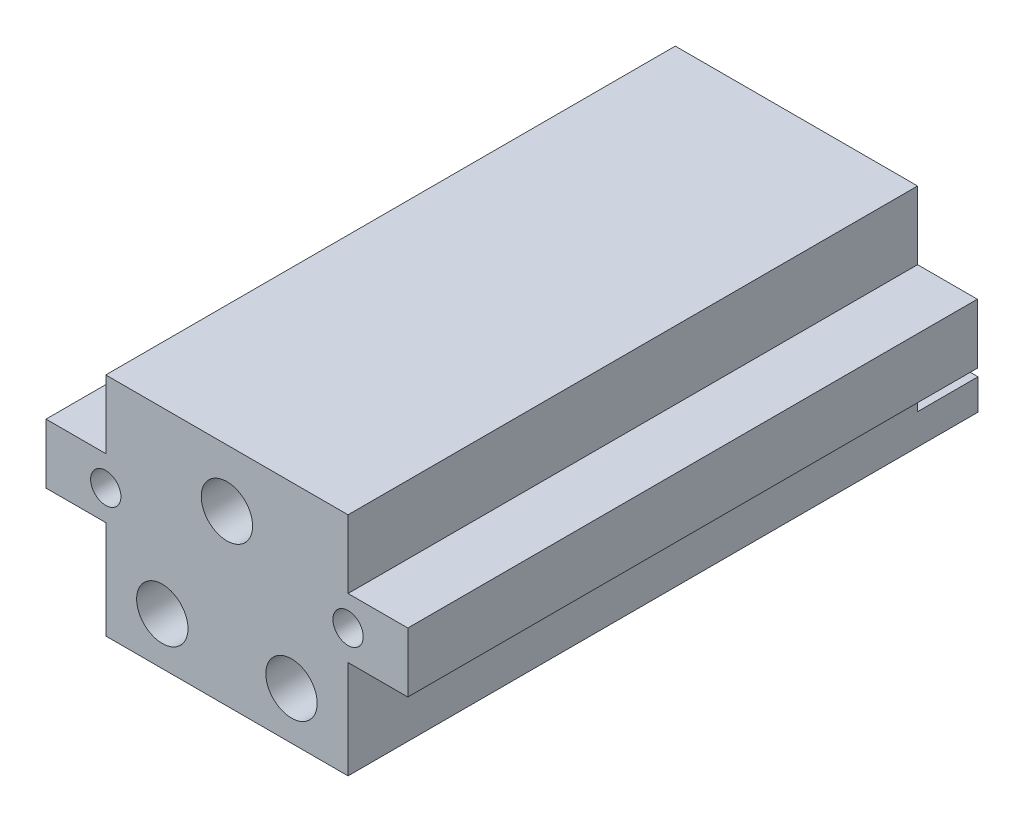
ISO-10303-21;
HEADER;
FILE_DESCRIPTION(('STEP AP214'),'2;1');
FILE_NAME('part.step','',(''),(''),'','','');
FILE_SCHEMA(('AUTOMOTIVE_DESIGN { 1 0 10303 214 1 1 1 1 }'));
ENDSEC;
DATA;
#1=APPLICATION_CONTEXT('core data for automotive mechanical design processes');
#2=APPLICATION_PROTOCOL_DEFINITION('international standard','automotive_design',2000,#1);
#3=PRODUCT_CONTEXT('',#1,'mechanical');
#4=PRODUCT('Part','Part','',(#3));
#5=PRODUCT_RELATED_PRODUCT_CATEGORY('part','',(#4));
#6=PRODUCT_DEFINITION_FORMATION('','',#4);
#7=PRODUCT_DEFINITION_CONTEXT('part definition',#1,'design');
#8=PRODUCT_DEFINITION('design','',#6,#7);
#9=PRODUCT_DEFINITION_SHAPE('','',#8);
#10=(LENGTH_UNIT() NAMED_UNIT(*) SI_UNIT(.MILLI.,.METRE.));
#11=(NAMED_UNIT(*) PLANE_ANGLE_UNIT() SI_UNIT($,.RADIAN.));
#12=(NAMED_UNIT(*) SI_UNIT($,.STERADIAN.) SOLID_ANGLE_UNIT());
#13=UNCERTAINTY_MEASURE_WITH_UNIT(LENGTH_MEASURE(1.E-05),#10,'distance_accuracy_value','');
#14=(GEOMETRIC_REPRESENTATION_CONTEXT(3) GLOBAL_UNCERTAINTY_ASSIGNED_CONTEXT((#13)) GLOBAL_UNIT_ASSIGNED_CONTEXT((#10,
#11,#12)) REPRESENTATION_CONTEXT('',''));
#15=CARTESIAN_POINT('',(0.,0.,0.));
#16=DIRECTION('',(0.,0.,1.));
#17=DIRECTION('',(1.,0.,0.));
#18=AXIS2_PLACEMENT_3D('',#15,#16,#17);
#19=CARTESIAN_POINT('',(-9.525,2.3495,24.765));
#20=DIRECTION('',(1.,0.,0.));
#21=DIRECTION('',(0.,1.,0.));
#22=AXIS2_PLACEMENT_3D('',#19,#20,#21);
#23=PLANE('',#22);
#24=DIRECTION('',(0.,1.,0.));
#25=VECTOR('',#24,1.);
#26=CARTESIAN_POINT('',(-9.525,2.3495,-20.0152));
#27=LINE('',#26,#25);
#28=CARTESIAN_POINT('',(-9.525,2.3495,-20.0152));
#29=VERTEX_POINT('',#28);
#30=CARTESIAN_POINT('',(-9.525,7.7089,-20.0152));
#31=VERTEX_POINT('',#30);
#32=EDGE_CURVE('E243',#29,#31,#27,.T.);
#33=ORIENTED_EDGE('',*,*,#32,.F.);
#34=DIRECTION('',(0.,0.,-1.));
#35=VECTOR('',#34,1.);
#36=CARTESIAN_POINT('',(-9.525,2.3495,24.765));
#37=LINE('',#36,#35);
#38=CARTESIAN_POINT('',(-9.525,2.3495,24.765));
#39=VERTEX_POINT('',#38);
#40=EDGE_CURVE('E42',#39,#29,#37,.T.);
#41=ORIENTED_EDGE('',*,*,#40,.F.);
#42=DIRECTION('',(0.,-1.,0.));
#43=VECTOR('',#42,1.);
#44=CARTESIAN_POINT('',(-9.525,2.3495,24.765));
#45=LINE('',#44,#43);
#46=CARTESIAN_POINT('',(-9.525,7.7089,24.765));
#47=VERTEX_POINT('',#46);
#48=EDGE_CURVE('E253',#47,#39,#45,.T.);
#49=ORIENTED_EDGE('',*,*,#48,.F.);
#50=DIRECTION('',(0.,0.,-1.));
#51=VECTOR('',#50,1.);
#52=CARTESIAN_POINT('',(-9.525,7.7089,24.765));
#53=LINE('',#52,#51);
#54=EDGE_CURVE('E276',#47,#31,#53,.T.);
#55=ORIENTED_EDGE('',*,*,#54,.T.);
#56=EDGE_LOOP('',(#33,#41,#49,#55));
#57=FACE_BOUND('',#56,.T.);
#58=ADVANCED_FACE('F35',(#57),#23,.F.);
#59=CARTESIAN_POINT('',(-14.224,2.3495,24.765));
#60=DIRECTION('',(0.,-1.,0.));
#61=DIRECTION('',(1.,0.,0.));
#62=AXIS2_PLACEMENT_3D('',#59,#60,#61);
#63=PLANE('',#62);
#64=DIRECTION('',(1.,0.,0.));
#65=VECTOR('',#64,1.);
#66=CARTESIAN_POINT('',(-14.224,2.3495,-20.0152));
#67=LINE('',#66,#65);
#68=CARTESIAN_POINT('',(-14.224,2.3495,-20.0152));
#69=VERTEX_POINT('',#68);
#70=EDGE_CURVE('E241',#69,#29,#67,.T.);
#71=ORIENTED_EDGE('',*,*,#70,.F.);
#72=DIRECTION('',(0.,0.,-1.));
#73=VECTOR('',#72,1.);
#74=CARTESIAN_POINT('',(-14.224,2.3495,24.765));
#75=LINE('',#74,#73);
#76=CARTESIAN_POINT('',(-14.224,2.3495,24.765));
#77=VERTEX_POINT('',#76);
#78=EDGE_CURVE('E305',#77,#69,#75,.T.);
#79=ORIENTED_EDGE('',*,*,#78,.F.);
#80=DIRECTION('',(-1.,0.,0.));
#81=VECTOR('',#80,1.);
#82=CARTESIAN_POINT('',(-14.224,2.3495,24.765));
#83=LINE('',#82,#81);
#84=EDGE_CURVE('E255',#39,#77,#83,.T.);
#85=ORIENTED_EDGE('',*,*,#84,.F.);
#86=ORIENTED_EDGE('',*,*,#40,.T.);
#87=EDGE_LOOP('',(#71,#79,#85,#86));
#88=FACE_BOUND('',#87,.T.);
#89=ADVANCED_FACE('F311',(#88),#63,.F.);
#90=CARTESIAN_POINT('',(-14.224,-2.3495,24.765));
#91=DIRECTION('',(1.,0.,0.));
#92=DIRECTION('',(0.,1.,0.));
#93=AXIS2_PLACEMENT_3D('',#90,#91,#92);
#94=PLANE('',#93);
#95=DIRECTION('',(0.,1.,0.));
#96=VECTOR('',#95,1.);
#97=CARTESIAN_POINT('',(-14.224,-7.6581,-20.0152));
#98=LINE('',#97,#96);
#99=CARTESIAN_POINT('',(-14.224,-2.3495,-20.0152));
#100=VERTEX_POINT('',#99);
#101=EDGE_CURVE('E218',#100,#69,#98,.T.);
#102=ORIENTED_EDGE('',*,*,#101,.F.);
#103=DIRECTION('',(0.,0.,-1.));
#104=VECTOR('',#103,1.);
#105=CARTESIAN_POINT('',(-14.224,-2.3495,24.765));
#106=LINE('',#105,#104);
#107=CARTESIAN_POINT('',(-14.224,-2.3495,24.765));
#108=VERTEX_POINT('',#107);
#109=EDGE_CURVE('E302',#108,#100,#106,.T.);
#110=ORIENTED_EDGE('',*,*,#109,.F.);
#111=DIRECTION('',(0.,-1.,0.));
#112=VECTOR('',#111,1.);
#113=CARTESIAN_POINT('',(-14.224,-2.3495,24.765));
#114=LINE('',#113,#112);
#115=EDGE_CURVE('E257',#77,#108,#114,.T.);
#116=ORIENTED_EDGE('',*,*,#115,.F.);
#117=ORIENTED_EDGE('',*,*,#78,.T.);
#118=EDGE_LOOP('',(#102,#110,#116,#117));
#119=FACE_BOUND('',#118,.T.);
#120=ADVANCED_FACE('F369',(#119),#94,.F.);
#121=CARTESIAN_POINT('',(-9.525,-2.3495,24.765));
#122=DIRECTION('',(0.,1.,0.));
#123=DIRECTION('',(-1.,0.,0.));
#124=AXIS2_PLACEMENT_3D('',#121,#122,#123);
#125=PLANE('',#124);
#126=DIRECTION('',(-1.,0.,0.));
#127=VECTOR('',#126,1.);
#128=CARTESIAN_POINT('',(-9.52499999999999,-2.3495,-20.0152));
#129=LINE('',#128,#127);
#130=CARTESIAN_POINT('',(-9.525,-2.3495,-20.0152));
#131=VERTEX_POINT('',#130);
#132=EDGE_CURVE('E239',#131,#100,#129,.T.);
#133=ORIENTED_EDGE('',*,*,#132,.F.);
#134=DIRECTION('',(0.,0.,-1.));
#135=VECTOR('',#134,1.);
#136=CARTESIAN_POINT('',(-9.525,-2.3495,24.765));
#137=LINE('',#136,#135);
#138=CARTESIAN_POINT('',(-9.525,-2.3495,24.765));
#139=VERTEX_POINT('',#138);
#140=EDGE_CURVE('E299',#139,#131,#137,.T.);
#141=ORIENTED_EDGE('',*,*,#140,.F.);
#142=DIRECTION('',(1.,0.,0.));
#143=VECTOR('',#142,1.);
#144=CARTESIAN_POINT('',(-9.525,-2.3495,24.765));
#145=LINE('',#144,#143);
#146=EDGE_CURVE('E259',#108,#139,#145,.T.);
#147=ORIENTED_EDGE('',*,*,#146,.F.);
#148=ORIENTED_EDGE('',*,*,#109,.T.);
#149=EDGE_LOOP('',(#133,#141,#147,#148));
#150=FACE_BOUND('',#149,.T.);
#151=ADVANCED_FACE('F366',(#150),#125,.F.);
#152=CARTESIAN_POINT('',(-9.525,-10.0711,24.765));
#153=DIRECTION('',(1.,0.,0.));
#154=DIRECTION('',(0.,1.,0.));
#155=AXIS2_PLACEMENT_3D('',#152,#153,#154);
#156=PLANE('',#155);
#157=DIRECTION('',(0.,1.,0.));
#158=VECTOR('',#157,1.);
#159=CARTESIAN_POINT('',(-9.525,-10.0711,-20.0152));
#160=LINE('',#159,#158);
#161=CARTESIAN_POINT('',(-9.525,-7.6581,-20.0152));
#162=VERTEX_POINT('',#161);
#163=EDGE_CURVE('E237',#162,#131,#160,.T.);
#164=ORIENTED_EDGE('',*,*,#163,.F.);
#165=DIRECTION('',(0.,0.,-1.));
#166=VECTOR('',#165,1.);
#167=CARTESIAN_POINT('',(-9.525,-7.6581,24.765));
#168=LINE('',#167,#166);
#169=CARTESIAN_POINT('',(-9.525,-7.6581,-24.765));
#170=VERTEX_POINT('',#169);
#171=EDGE_CURVE('E226',#162,#170,#168,.T.);
#172=ORIENTED_EDGE('',*,*,#171,.T.);
#173=DIRECTION('',(0.,-1.,0.));
#174=VECTOR('',#173,1.);
#175=CARTESIAN_POINT('',(-9.525,-10.0711,-24.765));
#176=LINE('',#175,#174);
#177=CARTESIAN_POINT('',(-9.525,-10.0711,-24.765));
#178=VERTEX_POINT('',#177);
#179=EDGE_CURVE('E245',#170,#178,#176,.T.);
#180=ORIENTED_EDGE('',*,*,#179,.T.);
#181=DIRECTION('',(0.,0.,-1.));
#182=VECTOR('',#181,1.);
#183=CARTESIAN_POINT('',(-9.525,-10.0711,24.765));
#184=LINE('',#183,#182);
#185=CARTESIAN_POINT('',(-9.525,-10.0711,24.765));
#186=VERTEX_POINT('',#185);
#187=EDGE_CURVE('E296',#186,#178,#184,.T.);
#188=ORIENTED_EDGE('',*,*,#187,.F.);
#189=DIRECTION('',(0.,-1.,0.));
#190=VECTOR('',#189,1.);
#191=CARTESIAN_POINT('',(-9.525,-10.0711,24.765));
#192=LINE('',#191,#190);
#193=EDGE_CURVE('E261',#139,#186,#192,.T.);
#194=ORIENTED_EDGE('',*,*,#193,.F.);
#195=ORIENTED_EDGE('',*,*,#140,.T.);
#196=EDGE_LOOP('',(#164,#172,#180,#188,#194,#195));
#197=FACE_BOUND('',#196,.T.);
#198=ADVANCED_FACE('F348',(#197),#156,.F.);
#199=CARTESIAN_POINT('',(9.52500000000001,-2.3495,24.765));
#200=DIRECTION('',(-1.,0.,0.));
#201=DIRECTION('',(0.,-1.,0.));
#202=AXIS2_PLACEMENT_3D('',#199,#200,#201);
#203=PLANE('',#202);
#204=DIRECTION('',(0.,-1.,0.));
#205=VECTOR('',#204,1.);
#206=CARTESIAN_POINT('',(9.52500000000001,-2.3495,-20.0152));
#207=LINE('',#206,#205);
#208=CARTESIAN_POINT('',(9.52500000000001,-2.3495,-20.0152));
#209=VERTEX_POINT('',#208);
#210=CARTESIAN_POINT('',(9.525,-7.6581,-20.0152));
#211=VERTEX_POINT('',#210);
#212=EDGE_CURVE('E235',#209,#211,#207,.T.);
#213=ORIENTED_EDGE('',*,*,#212,.F.);
#214=DIRECTION('',(0.,0.,-1.));
#215=VECTOR('',#214,1.);
#216=CARTESIAN_POINT('',(9.52500000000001,-2.3495,24.765));
#217=LINE('',#216,#215);
#218=CARTESIAN_POINT('',(9.52500000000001,-2.3495,24.765));
#219=VERTEX_POINT('',#218);
#220=EDGE_CURVE('E291',#219,#209,#217,.T.);
#221=ORIENTED_EDGE('',*,*,#220,.F.);
#222=DIRECTION('',(0.,1.,0.));
#223=VECTOR('',#222,1.);
#224=CARTESIAN_POINT('',(9.52500000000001,-2.3495,24.765));
#225=LINE('',#224,#223);
#226=CARTESIAN_POINT('',(9.525,-10.0711,24.765));
#227=VERTEX_POINT('',#226);
#228=EDGE_CURVE('E265',#227,#219,#225,.T.);
#229=ORIENTED_EDGE('',*,*,#228,.F.);
#230=DIRECTION('',(0.,0.,-1.));
#231=VECTOR('',#230,1.);
#232=CARTESIAN_POINT('',(9.525,-10.0711,24.765));
#233=LINE('',#232,#231);
#234=CARTESIAN_POINT('',(9.525,-10.0711,-24.765));
#235=VERTEX_POINT('',#234);
#236=EDGE_CURVE('E294',#227,#235,#233,.T.);
#237=ORIENTED_EDGE('',*,*,#236,.T.);
#238=DIRECTION('',(0.,1.,0.));
#239=VECTOR('',#238,1.);
#240=CARTESIAN_POINT('',(9.52500000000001,-2.3495,-24.765));
#241=LINE('',#240,#239);
#242=CARTESIAN_POINT('',(9.525,-7.6581,-24.765));
#243=VERTEX_POINT('',#242);
#244=EDGE_CURVE('E250',#235,#243,#241,.T.);
#245=ORIENTED_EDGE('',*,*,#244,.T.);
#246=DIRECTION('',(0.,0.,1.));
#247=VECTOR('',#246,1.);
#248=CARTESIAN_POINT('',(9.525,-7.6581,24.765));
#249=LINE('',#248,#247);
#250=EDGE_CURVE('E49',#243,#211,#249,.T.);
#251=ORIENTED_EDGE('',*,*,#250,.T.);
#252=EDGE_LOOP('',(#213,#221,#229,#237,#245,#251));
#253=FACE_BOUND('',#252,.T.);
#254=ADVANCED_FACE('F343',(#253),#203,.F.);
#255=CARTESIAN_POINT('',(14.224,-2.3495,24.765));
#256=DIRECTION('',(0.,1.,0.));
#257=DIRECTION('',(-1.,0.,0.));
#258=AXIS2_PLACEMENT_3D('',#255,#256,#257);
#259=PLANE('',#258);
#260=DIRECTION('',(-1.,0.,0.));
#261=VECTOR('',#260,1.);
#262=CARTESIAN_POINT('',(14.224,-2.3495,-20.0152));
#263=LINE('',#262,#261);
#264=CARTESIAN_POINT('',(14.224,-2.3495,-20.0152));
#265=VERTEX_POINT('',#264);
#266=EDGE_CURVE('E233',#265,#209,#263,.T.);
#267=ORIENTED_EDGE('',*,*,#266,.F.);
#268=DIRECTION('',(0.,0.,-1.));
#269=VECTOR('',#268,1.);
#270=CARTESIAN_POINT('',(14.224,-2.3495,24.765));
#271=LINE('',#270,#269);
#272=CARTESIAN_POINT('',(14.224,-2.3495,24.765));
#273=VERTEX_POINT('',#272);
#274=EDGE_CURVE('E288',#273,#265,#271,.T.);
#275=ORIENTED_EDGE('',*,*,#274,.F.);
#276=DIRECTION('',(1.,0.,0.));
#277=VECTOR('',#276,1.);
#278=CARTESIAN_POINT('',(14.224,-2.3495,24.765));
#279=LINE('',#278,#277);
#280=EDGE_CURVE('E267',#219,#273,#279,.T.);
#281=ORIENTED_EDGE('',*,*,#280,.F.);
#282=ORIENTED_EDGE('',*,*,#220,.T.);
#283=EDGE_LOOP('',(#267,#275,#281,#282));
#284=FACE_BOUND('',#283,.T.);
#285=ADVANCED_FACE('F338',(#284),#259,.F.);
#286=CARTESIAN_POINT('',(14.224,2.3495,24.765));
#287=DIRECTION('',(-1.,0.,0.));
#288=DIRECTION('',(0.,0.,1.));
#289=AXIS2_PLACEMENT_3D('',#286,#287,#288);
#290=PLANE('',#289);
#291=DIRECTION('',(0.,1.,0.));
#292=VECTOR('',#291,1.);
#293=CARTESIAN_POINT('',(14.224,-7.6581,-20.0152));
#294=LINE('',#293,#292);
#295=CARTESIAN_POINT('',(14.224,2.3495,-20.0152));
#296=VERTEX_POINT('',#295);
#297=EDGE_CURVE('E222',#265,#296,#294,.T.);
#298=ORIENTED_EDGE('',*,*,#297,.T.);
#299=DIRECTION('',(0.,0.,-1.));
#300=VECTOR('',#299,1.);
#301=CARTESIAN_POINT('',(14.224,2.3495,24.765));
#302=LINE('',#301,#300);
#303=CARTESIAN_POINT('',(14.224,2.3495,24.765));
#304=VERTEX_POINT('',#303);
#305=EDGE_CURVE('E285',#304,#296,#302,.T.);
#306=ORIENTED_EDGE('',*,*,#305,.F.);
#307=DIRECTION('',(0.,1.,0.));
#308=VECTOR('',#307,1.);
#309=CARTESIAN_POINT('',(14.224,2.3495,24.765));
#310=LINE('',#309,#308);
#311=EDGE_CURVE('E269',#273,#304,#310,.T.);
#312=ORIENTED_EDGE('',*,*,#311,.F.);
#313=ORIENTED_EDGE('',*,*,#274,.T.);
#314=EDGE_LOOP('',(#298,#306,#312,#313));
#315=FACE_BOUND('',#314,.T.);
#316=ADVANCED_FACE('F333',(#315),#290,.F.);
#317=CARTESIAN_POINT('',(9.52500000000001,2.3495,24.765));
#318=DIRECTION('',(0.,-1.,0.));
#319=DIRECTION('',(0.,0.,-1.));
#320=AXIS2_PLACEMENT_3D('',#317,#318,#319);
#321=PLANE('',#320);
#322=DIRECTION('',(1.,0.,0.));
#323=VECTOR('',#322,1.);
#324=CARTESIAN_POINT('',(9.52500000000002,2.3495,-20.0152));
#325=LINE('',#324,#323);
#326=CARTESIAN_POINT('',(9.52500000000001,2.3495,-20.0152));
#327=VERTEX_POINT('',#326);
#328=EDGE_CURVE('E231',#327,#296,#325,.T.);
#329=ORIENTED_EDGE('',*,*,#328,.F.);
#330=DIRECTION('',(0.,0.,-1.));
#331=VECTOR('',#330,1.);
#332=CARTESIAN_POINT('',(9.52500000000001,2.3495,24.765));
#333=LINE('',#332,#331);
#334=CARTESIAN_POINT('',(9.52500000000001,2.3495,24.765));
#335=VERTEX_POINT('',#334);
#336=EDGE_CURVE('E282',#335,#327,#333,.T.);
#337=ORIENTED_EDGE('',*,*,#336,.F.);
#338=DIRECTION('',(-1.,0.,0.));
#339=VECTOR('',#338,1.);
#340=CARTESIAN_POINT('',(9.52500000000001,2.3495,24.765));
#341=LINE('',#340,#339);
#342=EDGE_CURVE('E271',#304,#335,#341,.T.);
#343=ORIENTED_EDGE('',*,*,#342,.F.);
#344=ORIENTED_EDGE('',*,*,#305,.T.);
#345=EDGE_LOOP('',(#329,#337,#343,#344));
#346=FACE_BOUND('',#345,.T.);
#347=ADVANCED_FACE('F328',(#346),#321,.F.);
#348=CARTESIAN_POINT('',(9.52500000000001,7.7089,24.765));
#349=DIRECTION('',(-1.,0.,0.));
#350=DIRECTION('',(0.,-1.,0.));
#351=AXIS2_PLACEMENT_3D('',#348,#349,#350);
#352=PLANE('',#351);
#353=DIRECTION('',(0.,-1.,0.));
#354=VECTOR('',#353,1.);
#355=CARTESIAN_POINT('',(9.52500000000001,7.7089,-20.0152));
#356=LINE('',#355,#354);
#357=CARTESIAN_POINT('',(9.52500000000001,7.7089,-20.0152));
#358=VERTEX_POINT('',#357);
#359=EDGE_CURVE('E229',#358,#327,#356,.T.);
#360=ORIENTED_EDGE('',*,*,#359,.F.);
#361=DIRECTION('',(0.,0.,-1.));
#362=VECTOR('',#361,1.);
#363=CARTESIAN_POINT('',(9.52500000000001,7.7089,24.765));
#364=LINE('',#363,#362);
#365=CARTESIAN_POINT('',(9.52500000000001,7.7089,24.765));
#366=VERTEX_POINT('',#365);
#367=EDGE_CURVE('E279',#366,#358,#364,.T.);
#368=ORIENTED_EDGE('',*,*,#367,.F.);
#369=DIRECTION('',(0.,1.,0.));
#370=VECTOR('',#369,1.);
#371=CARTESIAN_POINT('',(9.52500000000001,7.7089,24.765));
#372=LINE('',#371,#370);
#373=EDGE_CURVE('E273',#335,#366,#372,.T.);
#374=ORIENTED_EDGE('',*,*,#373,.F.);
#375=ORIENTED_EDGE('',*,*,#336,.T.);
#376=EDGE_LOOP('',(#360,#368,#374,#375));
#377=FACE_BOUND('',#376,.T.);
#378=ADVANCED_FACE('F324',(#377),#352,.F.);
#379=CARTESIAN_POINT('',(-9.525,7.7089,24.765));
#380=DIRECTION('',(0.,-1.,0.));
#381=DIRECTION('',(1.,0.,0.));
#382=AXIS2_PLACEMENT_3D('',#379,#380,#381);
#383=PLANE('',#382);
#384=DIRECTION('',(-1.,0.,0.));
#385=VECTOR('',#384,1.);
#386=CARTESIAN_POINT('',(14.224,7.7089,-20.0152));
#387=LINE('',#386,#385);
#388=EDGE_CURVE('E214',#358,#31,#387,.T.);
#389=ORIENTED_EDGE('',*,*,#388,.T.);
#390=ORIENTED_EDGE('',*,*,#54,.F.);
#391=DIRECTION('',(-1.,0.,0.));
#392=VECTOR('',#391,1.);
#393=CARTESIAN_POINT('',(-9.525,7.7089,24.765));
#394=LINE('',#393,#392);
#395=EDGE_CURVE('E56',#366,#47,#394,.T.);
#396=ORIENTED_EDGE('',*,*,#395,.F.);
#397=ORIENTED_EDGE('',*,*,#367,.T.);
#398=EDGE_LOOP('',(#389,#390,#396,#397));
#399=FACE_BOUND('',#398,.T.);
#400=ADVANCED_FACE('F320',(#399),#383,.F.);
#401=CARTESIAN_POINT('',(9.525,-10.0711,24.765));
#402=DIRECTION('',(0.,1.,0.));
#403=DIRECTION('',(-1.,0.,0.));
#404=AXIS2_PLACEMENT_3D('',#401,#402,#403);
#405=PLANE('',#404);
#406=CARTESIAN_POINT('',(0.,-10.0711,8.89));
#407=DIRECTION('',(0.,-1.,0.));
#408=DIRECTION('',(0.,0.,-1.));
#409=AXIS2_PLACEMENT_3D('',#406,#407,#408);
#410=CIRCLE('',#409,3.17499999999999);
#411=CARTESIAN_POINT('',(0.,-10.0711,5.71500000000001));
#412=VERTEX_POINT('',#411);
#413=EDGE_CURVE('E196',#412,#412,#410,.T.);
#414=ORIENTED_EDGE('',*,*,#413,.F.);
#415=EDGE_LOOP('',(#414));
#416=FACE_BOUND('',#415,.T.);
#417=CARTESIAN_POINT('',(0.,-10.0711,19.2024));
#418=DIRECTION('',(0.,-1.,0.));
#419=DIRECTION('',(0.,0.,-1.));
#420=AXIS2_PLACEMENT_3D('',#417,#418,#419);
#421=CIRCLE('',#420,2.7051);
#422=CARTESIAN_POINT('',(0.,-10.0711,16.4973));
#423=VERTEX_POINT('',#422);
#424=EDGE_CURVE('E205',#423,#423,#421,.T.);
#425=ORIENTED_EDGE('',*,*,#424,.F.);
#426=EDGE_LOOP('',(#425));
#427=FACE_BOUND('',#426,.T.);
#428=CARTESIAN_POINT('',(0.,-10.0711,-1.42240000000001));
#429=DIRECTION('',(0.,-1.,0.));
#430=DIRECTION('',(0.,0.,-1.));
#431=AXIS2_PLACEMENT_3D('',#428,#429,#430);
#432=CIRCLE('',#431,2.7051);
#433=CARTESIAN_POINT('',(0.,-10.0711,-4.12750000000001));
#434=VERTEX_POINT('',#433);
#435=EDGE_CURVE('E211',#434,#434,#432,.T.);
#436=ORIENTED_EDGE('',*,*,#435,.F.);
#437=EDGE_LOOP('',(#436));
#438=FACE_BOUND('',#437,.T.);
#439=ORIENTED_EDGE('',*,*,#187,.T.);
#440=DIRECTION('',(1.,0.,0.));
#441=VECTOR('',#440,1.);
#442=CARTESIAN_POINT('',(9.525,-10.0711,-24.765));
#443=LINE('',#442,#441);
#444=EDGE_CURVE('E247',#178,#235,#443,.T.);
#445=ORIENTED_EDGE('',*,*,#444,.T.);
#446=ORIENTED_EDGE('',*,*,#236,.F.);
#447=DIRECTION('',(1.,0.,0.));
#448=VECTOR('',#447,1.);
#449=CARTESIAN_POINT('',(9.525,-10.0711,24.765));
#450=LINE('',#449,#448);
#451=EDGE_CURVE('E263',#186,#227,#450,.T.);
#452=ORIENTED_EDGE('',*,*,#451,.F.);
#453=EDGE_LOOP('',(#439,#445,#446,#452));
#454=FACE_BOUND('',#453,.T.);
#455=ADVANCED_FACE('F356',(#416,#427,#438,#454),#405,.F.);
#456=CARTESIAN_POINT('',(-9.525,-2.3495,24.765));
#457=DIRECTION('',(0.,0.,1.));
#458=DIRECTION('',(1.,0.,0.));
#459=AXIS2_PLACEMENT_3D('',#456,#457,#458);
#460=PLANE('',#459);
#461=CARTESIAN_POINT('',(-5.08,-6.3373,24.765));
#462=DIRECTION('',(0.,0.,1.));
#463=DIRECTION('',(1.,0.,0.));
#464=AXIS2_PLACEMENT_3D('',#461,#462,#463);
#465=CIRCLE('',#464,2.0193);
#466=CARTESIAN_POINT('',(-3.0607,-6.3373,24.765));
#467=VERTEX_POINT('',#466);
#468=EDGE_CURVE('E167',#467,#467,#465,.T.);
#469=ORIENTED_EDGE('',*,*,#468,.F.);
#470=EDGE_LOOP('',(#469));
#471=FACE_BOUND('',#470,.T.);
#472=CARTESIAN_POINT('',(5.08,-6.3373,24.765));
#473=DIRECTION('',(0.,0.,1.));
#474=DIRECTION('',(1.,0.,0.));
#475=AXIS2_PLACEMENT_3D('',#472,#473,#474);
#476=CIRCLE('',#475,2.0193);
#477=CARTESIAN_POINT('',(7.0993,-6.3373,24.765));
#478=VERTEX_POINT('',#477);
#479=EDGE_CURVE('E175',#478,#478,#476,.T.);
#480=ORIENTED_EDGE('',*,*,#479,.F.);
#481=EDGE_LOOP('',(#480));
#482=FACE_BOUND('',#481,.T.);
#483=CARTESIAN_POINT('',(0.,3.1877,24.765));
#484=DIRECTION('',(0.,0.,1.));
#485=DIRECTION('',(1.,0.,0.));
#486=AXIS2_PLACEMENT_3D('',#483,#484,#485);
#487=CIRCLE('',#486,2.0193);
#488=CARTESIAN_POINT('',(2.0193,3.1877,24.765));
#489=VERTEX_POINT('',#488);
#490=EDGE_CURVE('E181',#489,#489,#487,.T.);
#491=ORIENTED_EDGE('',*,*,#490,.F.);
#492=EDGE_LOOP('',(#491));
#493=FACE_BOUND('',#492,.T.);
#494=CARTESIAN_POINT('',(-9.525,0.0126999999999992,24.765));
#495=DIRECTION('',(0.,0.,1.));
#496=DIRECTION('',(1.,0.,0.));
#497=AXIS2_PLACEMENT_3D('',#494,#495,#496);
#498=CIRCLE('',#497,1.19126);
#499=CARTESIAN_POINT('',(-8.33374,0.0126999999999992,24.765));
#500=VERTEX_POINT('',#499);
#501=EDGE_CURVE('E187',#500,#500,#498,.T.);
#502=ORIENTED_EDGE('',*,*,#501,.F.);
#503=EDGE_LOOP('',(#502));
#504=FACE_BOUND('',#503,.T.);
#505=CARTESIAN_POINT('',(9.525,0.,24.765));
#506=DIRECTION('',(0.,0.,1.));
#507=DIRECTION('',(1.,0.,0.));
#508=AXIS2_PLACEMENT_3D('',#505,#506,#507);
#509=CIRCLE('',#508,1.19126);
#510=CARTESIAN_POINT('',(10.71626,0.,24.765));
#511=VERTEX_POINT('',#510);
#512=EDGE_CURVE('E193',#511,#511,#509,.T.);
#513=ORIENTED_EDGE('',*,*,#512,.F.);
#514=EDGE_LOOP('',(#513));
#515=FACE_BOUND('',#514,.T.);
#516=ORIENTED_EDGE('',*,*,#48,.T.);
#517=ORIENTED_EDGE('',*,*,#84,.T.);
#518=ORIENTED_EDGE('',*,*,#115,.T.);
#519=ORIENTED_EDGE('',*,*,#146,.T.);
#520=ORIENTED_EDGE('',*,*,#193,.T.);
#521=ORIENTED_EDGE('',*,*,#451,.T.);
#522=ORIENTED_EDGE('',*,*,#228,.T.);
#523=ORIENTED_EDGE('',*,*,#280,.T.);
#524=ORIENTED_EDGE('',*,*,#311,.T.);
#525=ORIENTED_EDGE('',*,*,#342,.T.);
#526=ORIENTED_EDGE('',*,*,#373,.T.);
#527=ORIENTED_EDGE('',*,*,#395,.T.);
#528=EDGE_LOOP('',(#516,#517,#518,#519,#520,#521,#522,#523,#524,#525,#526,#527));
#529=FACE_BOUND('',#528,.T.);
#530=ADVANCED_FACE('F360',(#471,#482,#493,#504,#515,#529),#460,.T.);
#531=CARTESIAN_POINT('',(-9.525,-2.3495,-24.765));
#532=DIRECTION('',(0.,0.,1.));
#533=DIRECTION('',(1.,0.,0.));
#534=AXIS2_PLACEMENT_3D('',#531,#532,#533);
#535=PLANE('',#534);
#536=ORIENTED_EDGE('',*,*,#179,.F.);
#537=DIRECTION('',(1.,0.,0.));
#538=VECTOR('',#537,1.);
#539=CARTESIAN_POINT('',(-9.525,-7.6581,-24.765));
#540=LINE('',#539,#538);
#541=EDGE_CURVE('E11',#170,#243,#540,.T.);
#542=ORIENTED_EDGE('',*,*,#541,.T.);
#543=ORIENTED_EDGE('',*,*,#244,.F.);
#544=ORIENTED_EDGE('',*,*,#444,.F.);
#545=EDGE_LOOP('',(#536,#542,#543,#544));
#546=FACE_BOUND('',#545,.T.);
#547=ADVANCED_FACE('F352',(#546),#535,.F.);
#548=CARTESIAN_POINT('',(14.224,-7.6581,-20.0152));
#549=DIRECTION('',(0.,0.,-1.));
#550=DIRECTION('',(-1.,0.,0.));
#551=AXIS2_PLACEMENT_3D('',#548,#549,#550);
#552=PLANE('',#551);
#553=ORIENTED_EDGE('',*,*,#32,.T.);
#554=ORIENTED_EDGE('',*,*,#388,.F.);
#555=ORIENTED_EDGE('',*,*,#359,.T.);
#556=ORIENTED_EDGE('',*,*,#328,.T.);
#557=ORIENTED_EDGE('',*,*,#297,.F.);
#558=ORIENTED_EDGE('',*,*,#266,.T.);
#559=ORIENTED_EDGE('',*,*,#212,.T.);
#560=DIRECTION('',(-1.,0.,0.));
#561=VECTOR('',#560,1.);
#562=CARTESIAN_POINT('',(14.224,-7.6581,-20.0152));
#563=LINE('',#562,#561);
#564=EDGE_CURVE('E215',#211,#162,#563,.T.);
#565=ORIENTED_EDGE('',*,*,#564,.T.);
#566=ORIENTED_EDGE('',*,*,#163,.T.);
#567=ORIENTED_EDGE('',*,*,#132,.T.);
#568=ORIENTED_EDGE('',*,*,#101,.T.);
#569=ORIENTED_EDGE('',*,*,#70,.T.);
#570=EDGE_LOOP('',(#553,#554,#555,#556,#557,#558,#559,#565,#566,#567,#568,#569));
#571=FACE_BOUND('',#570,.T.);
#572=ADVANCED_FACE('F317',(#571),#552,.T.);
#573=CARTESIAN_POINT('',(14.224,-7.6581,-24.765));
#574=DIRECTION('',(0.,-1.,0.));
#575=DIRECTION('',(1.,0.,0.));
#576=AXIS2_PLACEMENT_3D('',#573,#574,#575);
#577=PLANE('',#576);
#578=ORIENTED_EDGE('',*,*,#564,.F.);
#579=ORIENTED_EDGE('',*,*,#250,.F.);
#580=ORIENTED_EDGE('',*,*,#541,.F.);
#581=ORIENTED_EDGE('',*,*,#171,.F.);
#582=EDGE_LOOP('',(#578,#579,#580,#581));
#583=FACE_BOUND('',#582,.T.);
#584=ADVANCED_FACE('F345',(#583),#577,.F.);
#585=CARTESIAN_POINT('',(0.,-10.0711,-1.42240000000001));
#586=DIRECTION('',(0.,-1.,0.));
#587=DIRECTION('',(0.,0.,-1.));
#588=AXIS2_PLACEMENT_3D('',#585,#586,#587);
#589=CYLINDRICAL_SURFACE('',#588,2.7051);
#590=CARTESIAN_POINT('',(0.,-3.7211,-1.42240000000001));
#591=DIRECTION('',(0.,-1.,0.));
#592=DIRECTION('',(0.,0.,-1.));
#593=AXIS2_PLACEMENT_3D('',#590,#591,#592);
#594=CIRCLE('',#593,2.7051);
#595=CARTESIAN_POINT('',(0.,-3.7211,-4.12750000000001));
#596=VERTEX_POINT('',#595);
#597=EDGE_CURVE('E208',#596,#596,#594,.T.);
#598=ORIENTED_EDGE('',*,*,#597,.F.);
#599=EDGE_LOOP('',(#598));
#600=FACE_BOUND('',#599,.T.);
#601=ORIENTED_EDGE('',*,*,#435,.T.);
#602=EDGE_LOOP('',(#601));
#603=FACE_BOUND('',#602,.T.);
#604=ADVANCED_FACE('F478',(#600,#603),#589,.F.);
#605=CARTESIAN_POINT('',(0.,-3.7211,-1.42240000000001));
#606=DIRECTION('',(0.,-1.,0.));
#607=DIRECTION('',(0.,0.,-1.));
#608=AXIS2_PLACEMENT_3D('',#605,#606,#607);
#609=CONICAL_SURFACE('',#608,2.7051,1.02974425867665);
#610=CARTESIAN_POINT('',(0.,-2.09571193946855,-1.42240000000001));
#611=VERTEX_POINT('',#610);
#612=VERTEX_LOOP('',#611);
#613=FACE_BOUND('',#612,.T.);
#614=ORIENTED_EDGE('',*,*,#597,.T.);
#615=EDGE_LOOP('',(#614));
#616=FACE_BOUND('',#615,.T.);
#617=ADVANCED_FACE('F488',(#613,#616),#609,.F.);
#618=CARTESIAN_POINT('',(0.,-10.0711,19.2024));
#619=DIRECTION('',(0.,-1.,0.));
#620=DIRECTION('',(0.,0.,-1.));
#621=AXIS2_PLACEMENT_3D('',#618,#619,#620);
#622=CYLINDRICAL_SURFACE('',#621,2.7051);
#623=CARTESIAN_POINT('',(0.,-3.7211,19.2024));
#624=DIRECTION('',(0.,-1.,0.));
#625=DIRECTION('',(0.,0.,-1.));
#626=AXIS2_PLACEMENT_3D('',#623,#624,#625);
#627=CIRCLE('',#626,2.7051);
#628=CARTESIAN_POINT('',(0.,-3.7211,16.4973));
#629=VERTEX_POINT('',#628);
#630=EDGE_CURVE('E202',#629,#629,#627,.T.);
#631=ORIENTED_EDGE('',*,*,#630,.F.);
#632=EDGE_LOOP('',(#631));
#633=FACE_BOUND('',#632,.T.);
#634=ORIENTED_EDGE('',*,*,#424,.T.);
#635=EDGE_LOOP('',(#634));
#636=FACE_BOUND('',#635,.T.);
#637=ADVANCED_FACE('F500',(#633,#636),#622,.F.);
#638=CARTESIAN_POINT('',(0.,-3.7211,19.2024));
#639=DIRECTION('',(0.,-1.,0.));
#640=DIRECTION('',(0.,0.,-1.));
#641=AXIS2_PLACEMENT_3D('',#638,#639,#640);
#642=CONICAL_SURFACE('',#641,2.7051,1.02974425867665);
#643=CARTESIAN_POINT('',(0.,-2.09571193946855,19.2024));
#644=VERTEX_POINT('',#643);
#645=VERTEX_LOOP('',#644);
#646=FACE_BOUND('',#645,.T.);
#647=ORIENTED_EDGE('',*,*,#630,.T.);
#648=EDGE_LOOP('',(#647));
#649=FACE_BOUND('',#648,.T.);
#650=ADVANCED_FACE('F510',(#646,#649),#642,.F.);
#651=CARTESIAN_POINT('',(0.,-3.7211,8.89));
#652=DIRECTION('',(0.,-1.,0.));
#653=DIRECTION('',(0.,0.,-1.));
#654=AXIS2_PLACEMENT_3D('',#651,#652,#653);
#655=CONICAL_SURFACE('',#654,3.175,1.02974425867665);
#656=CARTESIAN_POINT('',(0.,-1.8133675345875,8.89));
#657=VERTEX_POINT('',#656);
#658=VERTEX_LOOP('',#657);
#659=FACE_BOUND('',#658,.T.);
#660=CARTESIAN_POINT('',(0.,-3.7211,8.89));
#661=DIRECTION('',(0.,-1.,0.));
#662=DIRECTION('',(0.,0.,-1.));
#663=AXIS2_PLACEMENT_3D('',#660,#661,#662);
#664=CIRCLE('',#663,3.175);
#665=CARTESIAN_POINT('',(0.,-3.7211,5.715));
#666=VERTEX_POINT('',#665);
#667=EDGE_CURVE('E199',#666,#666,#664,.T.);
#668=ORIENTED_EDGE('',*,*,#667,.T.);
#669=EDGE_LOOP('',(#668));
#670=FACE_BOUND('',#669,.T.);
#671=ADVANCED_FACE('F520',(#659,#670),#655,.F.);
#672=CARTESIAN_POINT('',(0.,-10.0711,8.89));
#673=DIRECTION('',(0.,-1.,0.));
#674=DIRECTION('',(0.,0.,-1.));
#675=AXIS2_PLACEMENT_3D('',#672,#673,#674);
#676=CYLINDRICAL_SURFACE('',#675,3.17499999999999);
#677=ORIENTED_EDGE('',*,*,#667,.F.);
#678=EDGE_LOOP('',(#677));
#679=FACE_BOUND('',#678,.T.);
#680=ORIENTED_EDGE('',*,*,#413,.T.);
#681=EDGE_LOOP('',(#680));
#682=FACE_BOUND('',#681,.T.);
#683=ADVANCED_FACE('F538',(#679,#682),#676,.F.);
#684=CARTESIAN_POINT('',(9.525,0.,24.765));
#685=DIRECTION('',(0.,0.,1.));
#686=DIRECTION('',(1.,0.,0.));
#687=AXIS2_PLACEMENT_3D('',#684,#685,#686);
#688=CYLINDRICAL_SURFACE('',#687,1.19126);
#689=CARTESIAN_POINT('',(9.525,0.,18.415));
#690=DIRECTION('',(0.,0.,1.));
#691=DIRECTION('',(1.,0.,0.));
#692=AXIS2_PLACEMENT_3D('',#689,#690,#691);
#693=CIRCLE('',#692,1.19126);
#694=CARTESIAN_POINT('',(10.71626,0.,18.415));
#695=VERTEX_POINT('',#694);
#696=EDGE_CURVE('E190',#695,#695,#693,.T.);
#697=ORIENTED_EDGE('',*,*,#696,.F.);
#698=EDGE_LOOP('',(#697));
#699=FACE_BOUND('',#698,.T.);
#700=ORIENTED_EDGE('',*,*,#512,.T.);
#701=EDGE_LOOP('',(#700));
#702=FACE_BOUND('',#701,.T.);
#703=ADVANCED_FACE('F548',(#699,#702),#688,.F.);
#704=CARTESIAN_POINT('',(9.525,0.,18.415));
#705=DIRECTION('',(0.,0.,1.));
#706=DIRECTION('',(1.,0.,0.));
#707=AXIS2_PLACEMENT_3D('',#704,#705,#706);
#708=CONICAL_SURFACE('',#707,1.19126,1.02974425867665);
#709=CARTESIAN_POINT('',(9.525,0.,17.6992187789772));
#710=VERTEX_POINT('',#709);
#711=VERTEX_LOOP('',#710);
#712=FACE_BOUND('',#711,.T.);
#713=ORIENTED_EDGE('',*,*,#696,.T.);
#714=EDGE_LOOP('',(#713));
#715=FACE_BOUND('',#714,.T.);
#716=ADVANCED_FACE('F558',(#712,#715),#708,.F.);
#717=CARTESIAN_POINT('',(-9.525,0.0126999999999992,24.765));
#718=DIRECTION('',(0.,0.,1.));
#719=DIRECTION('',(1.,0.,0.));
#720=AXIS2_PLACEMENT_3D('',#717,#718,#719);
#721=CYLINDRICAL_SURFACE('',#720,1.19126);
#722=CARTESIAN_POINT('',(-9.525,0.0126999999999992,18.415));
#723=DIRECTION('',(0.,0.,1.));
#724=DIRECTION('',(1.,0.,0.));
#725=AXIS2_PLACEMENT_3D('',#722,#723,#724);
#726=CIRCLE('',#725,1.19126);
#727=CARTESIAN_POINT('',(-8.33374,0.0126999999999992,18.415));
#728=VERTEX_POINT('',#727);
#729=EDGE_CURVE('E184',#728,#728,#726,.T.);
#730=ORIENTED_EDGE('',*,*,#729,.F.);
#731=EDGE_LOOP('',(#730));
#732=FACE_BOUND('',#731,.T.);
#733=ORIENTED_EDGE('',*,*,#501,.T.);
#734=EDGE_LOOP('',(#733));
#735=FACE_BOUND('',#734,.T.);
#736=ADVANCED_FACE('F568',(#732,#735),#721,.F.);
#737=CARTESIAN_POINT('',(-9.525,0.0126999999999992,18.415));
#738=DIRECTION('',(0.,0.,1.));
#739=DIRECTION('',(1.,0.,0.));
#740=AXIS2_PLACEMENT_3D('',#737,#738,#739);
#741=CONICAL_SURFACE('',#740,1.19126,1.02974425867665);
#742=CARTESIAN_POINT('',(-9.525,0.0126999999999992,17.6992187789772));
#743=VERTEX_POINT('',#742);
#744=VERTEX_LOOP('',#743);
#745=FACE_BOUND('',#744,.T.);
#746=ORIENTED_EDGE('',*,*,#729,.T.);
#747=EDGE_LOOP('',(#746));
#748=FACE_BOUND('',#747,.T.);
#749=ADVANCED_FACE('F578',(#745,#748),#741,.F.);
#750=CARTESIAN_POINT('',(0.,3.1877,24.765));
#751=DIRECTION('',(0.,0.,1.));
#752=DIRECTION('',(1.,0.,0.));
#753=AXIS2_PLACEMENT_3D('',#750,#751,#752);
#754=CYLINDRICAL_SURFACE('',#753,2.0193);
#755=CARTESIAN_POINT('',(0.,3.1877,12.065));
#756=DIRECTION('',(0.,0.,1.));
#757=DIRECTION('',(1.,0.,0.));
#758=AXIS2_PLACEMENT_3D('',#755,#756,#757);
#759=CIRCLE('',#758,2.0193);
#760=CARTESIAN_POINT('',(2.0193,3.1877,12.065));
#761=VERTEX_POINT('',#760);
#762=EDGE_CURVE('E178',#761,#761,#759,.T.);
#763=ORIENTED_EDGE('',*,*,#762,.F.);
#764=EDGE_LOOP('',(#763));
#765=FACE_BOUND('',#764,.T.);
#766=ORIENTED_EDGE('',*,*,#490,.T.);
#767=EDGE_LOOP('',(#766));
#768=FACE_BOUND('',#767,.T.);
#769=ADVANCED_FACE('F588',(#765,#768),#754,.F.);
#770=CARTESIAN_POINT('',(0.,3.1877,12.065));
#771=DIRECTION('',(0.,0.,1.));
#772=DIRECTION('',(1.,0.,0.));
#773=AXIS2_PLACEMENT_3D('',#770,#771,#772);
#774=CONICAL_SURFACE('',#773,2.0193,1.02974425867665);
#775=CARTESIAN_POINT('',(0.,3.1877,10.8516821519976));
#776=VERTEX_POINT('',#775);
#777=VERTEX_LOOP('',#776);
#778=FACE_BOUND('',#777,.T.);
#779=ORIENTED_EDGE('',*,*,#762,.T.);
#780=EDGE_LOOP('',(#779));
#781=FACE_BOUND('',#780,.T.);
#782=ADVANCED_FACE('F606',(#778,#781),#774,.F.);
#783=CARTESIAN_POINT('',(5.08,-6.3373,24.765));
#784=DIRECTION('',(0.,0.,1.));
#785=DIRECTION('',(1.,0.,0.));
#786=AXIS2_PLACEMENT_3D('',#783,#784,#785);
#787=CYLINDRICAL_SURFACE('',#786,2.0193);
#788=CARTESIAN_POINT('',(5.08,-6.3373,12.065));
#789=DIRECTION('',(0.,0.,1.));
#790=DIRECTION('',(1.,0.,0.));
#791=AXIS2_PLACEMENT_3D('',#788,#789,#790);
#792=CIRCLE('',#791,2.0193);
#793=CARTESIAN_POINT('',(7.0993,-6.3373,12.065));
#794=VERTEX_POINT('',#793);
#795=EDGE_CURVE('E170',#794,#794,#792,.T.);
#796=ORIENTED_EDGE('',*,*,#795,.F.);
#797=EDGE_LOOP('',(#796));
#798=FACE_BOUND('',#797,.T.);
#799=ORIENTED_EDGE('',*,*,#479,.T.);
#800=EDGE_LOOP('',(#799));
#801=FACE_BOUND('',#800,.T.);
#802=ADVANCED_FACE('F617',(#798,#801),#787,.F.);
#803=CARTESIAN_POINT('',(5.08,-6.3373,12.065));
#804=DIRECTION('',(0.,0.,1.));
#805=DIRECTION('',(1.,0.,0.));
#806=AXIS2_PLACEMENT_3D('',#803,#804,#805);
#807=CONICAL_SURFACE('',#806,2.0193,1.02974425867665);
#808=CARTESIAN_POINT('',(5.08,-6.3373,10.8516821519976));
#809=VERTEX_POINT('',#808);
#810=VERTEX_LOOP('',#809);
#811=FACE_BOUND('',#810,.T.);
#812=ORIENTED_EDGE('',*,*,#795,.T.);
#813=EDGE_LOOP('',(#812));
#814=FACE_BOUND('',#813,.T.);
#815=ADVANCED_FACE('F627',(#811,#814),#807,.F.);
#816=CARTESIAN_POINT('',(-5.08,-6.3373,24.765));
#817=DIRECTION('',(0.,0.,1.));
#818=DIRECTION('',(1.,0.,0.));
#819=AXIS2_PLACEMENT_3D('',#816,#817,#818);
#820=CYLINDRICAL_SURFACE('',#819,2.0193);
#821=CARTESIAN_POINT('',(-5.08,-6.3373,12.065));
#822=DIRECTION('',(0.,0.,1.));
#823=DIRECTION('',(1.,0.,0.));
#824=AXIS2_PLACEMENT_3D('',#821,#822,#823);
#825=CIRCLE('',#824,2.0193);
#826=CARTESIAN_POINT('',(-3.0607,-6.3373,12.065));
#827=VERTEX_POINT('',#826);
#828=EDGE_CURVE('E165',#827,#827,#825,.T.);
#829=ORIENTED_EDGE('',*,*,#828,.F.);
#830=EDGE_LOOP('',(#829));
#831=FACE_BOUND('',#830,.T.);
#832=ORIENTED_EDGE('',*,*,#468,.T.);
#833=EDGE_LOOP('',(#832));
#834=FACE_BOUND('',#833,.T.);
#835=ADVANCED_FACE('F161',(#831,#834),#820,.F.);
#836=CARTESIAN_POINT('',(-5.08,-6.3373,12.065));
#837=DIRECTION('',(0.,0.,1.));
#838=DIRECTION('',(1.,0.,0.));
#839=AXIS2_PLACEMENT_3D('',#836,#837,#838);
#840=CONICAL_SURFACE('',#839,2.0193,1.02974425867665);
#841=CARTESIAN_POINT('',(-5.08,-6.3373,10.8516821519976));
#842=VERTEX_POINT('',#841);
#843=VERTEX_LOOP('',#842);
#844=FACE_BOUND('',#843,.T.);
#845=ORIENTED_EDGE('',*,*,#828,.T.);
#846=EDGE_LOOP('',(#845));
#847=FACE_BOUND('',#846,.T.);
#848=ADVANCED_FACE('F158',(#844,#847),#840,.F.);
#849=CLOSED_SHELL('',(#58,#89,#120,#151,#198,#254,#285,#316,#347,#378,#400,#455,#530,#547,#572,
#584,#604,#617,#637,#650,#671,#683,#703,#716,#736,#749,#769,#782,#802,#815,#835,#848));
#850=MANIFOLD_SOLID_BREP('B2',#849);
#851=ADVANCED_BREP_SHAPE_REPRESENTATION('',(#18,#850),#14);
#852=SHAPE_DEFINITION_REPRESENTATION(#9,#851);
ENDSEC;
END-ISO-10303-21;
